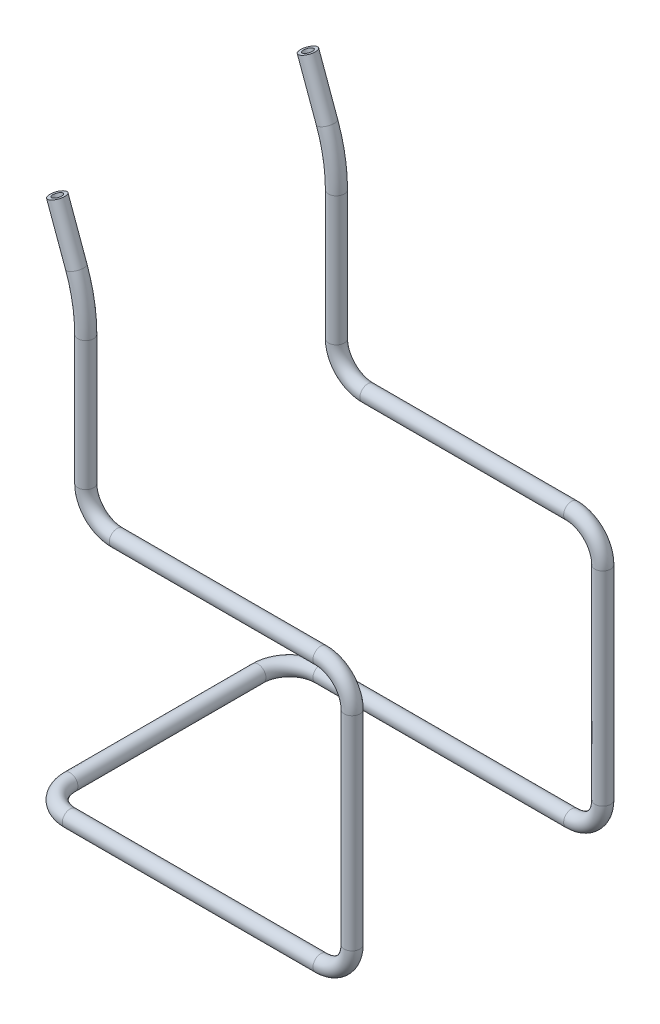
from build123d import *

# Parameters (mm, degrees)
SKETCH1_R   = 2.5
SKETCH1_R_2 = 1.5


with BuildPart() as part:
    # Sweep-Thin1: sweep along a curve in space
    with BuildLine() as sweep_thin1_path:
        Line((0, 0, 0), (0, 0, 30))
        ThreePointArc((10, 0, 40), (2.928932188, 0, 37.071067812), (0, 0, 30))
        Line((10, 0, 40), (90, 0, 40))
        ThreePointArc((100, 10, 40), (97.071067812, 2.928932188, 40), (90, 0, 40))
        Line((100, 10, 40), (100, 75, 40))
        ThreePointArc((90, 85, 40), (97.071067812, 82.071067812, 40), (100, 75, 40))
        Line((90, 85, 40), (25, 85, 40))
        ThreePointArc((15, 95, 40), (17.928932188, 87.928932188, 40), (25, 85, 40))
        Line((15, 95, 40), (15, 136.183650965, 40))
        ThreePointArc((11.984631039, 153.284658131, 40), (14.240387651, 144.866059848, 40), (15, 136.183650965, 40))
        Line((11.984631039, 153.284658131, 40), (5.900744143, 170, 40))
    # Sketch1 → Sweep-Thin1 (sweep)
    with BuildSketch(Plane.XY):
        Circle(SKETCH1_R)
        Circle(SKETCH1_R_2, mode=Mode.SUBTRACT)
    sweep_thin1 = sweep(path=sweep_thin1_path.line)

    # Mirror1: Sweep-Thin1 across plane
    add(sweep_thin1.mirror(Plane.XY))


solid = part.part
